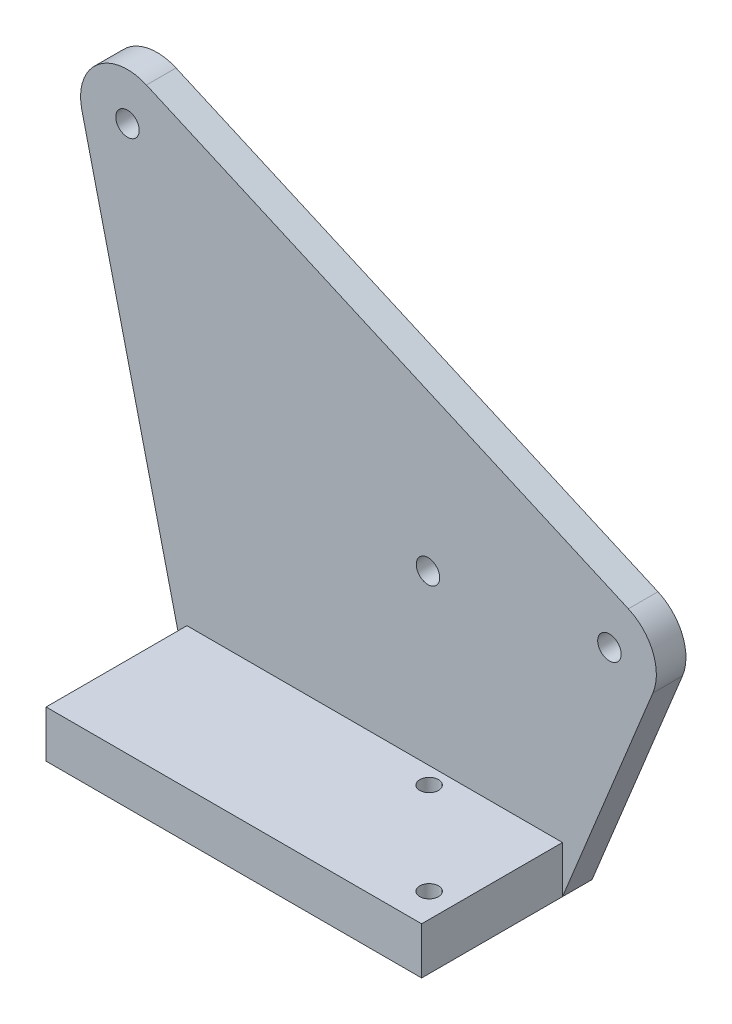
from build123d import *

# Parameters (mm, degrees)
SKETCH1_R           = 3.175
BOSS_EXTRUDE1_DEPTH = 4
SKETCH2_W           = 101.6
SKETCH2_H           = 12.7
BOSS_EXTRUDE2_DEPTH = 38.1
SKETCH3_R           = 3.175
CUT_EXTRUDE1_DEPTH  = 8
SKETCH4_R           = 2.54
CUT_EXTRUDE2_DEPTH  = 12.7


with BuildPart() as part:
    # Sketch1 → Boss-Extrude1 (new, symmetric)
    with BuildSketch(Plane.XY):
        with BuildLine():
            Line((5.127066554, 11.619087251), (-125.251133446, 69.150087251))
            ThreePointArc((-125.251133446, 69.150087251), (-138.50687017, 67.288803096), (-142.732372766, 54.587462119))
            Line((-142.732372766, 54.587462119), (-114.3, -64.7446))
            Line((-114.3, -64.7446), (-12.7, -64.7446))
            Line((-12.7, -64.7446), (11.7588969, -4.797743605))
            ThreePointArc((11.7588969, -4.797743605), (11.775484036, 4.756887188), (5.127066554, 11.619087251))
        make_face()
        with Locations((-130.3782, 57.531)):
            Circle(SKETCH1_R, mode=Mode.SUBTRACT)
        Circle(SKETCH1_R, mode=Mode.SUBTRACT)
    extrude(amount=BOSS_EXTRUDE1_DEPTH, both=True)

    # Sketch2 → Boss-Extrude2 (add)
    with BuildSketch(Plane.XY.offset(4)):
        with Locations((-63.5, -58.3946)):
            Rectangle(SKETCH2_W, SKETCH2_H)
    extrude(amount=BOSS_EXTRUDE2_DEPTH)

    # Sketch3 → Cut-Extrude1 (cut)
    with BuildSketch(Plane.XY.offset(4)):
        with Locations((-49.081699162, -6.648887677)):
            Circle(SKETCH3_R)
    extrude(amount=-CUT_EXTRUDE1_DEPTH, mode=Mode.SUBTRACT)

    # Sketch4 → Cut-Extrude2 (cut)
    with BuildSketch(Plane.XZ.offset(64.7446)):
        with Locations(Location((-19.304, 33.464, 0), (0, 0, 270))):
            Circle(SKETCH4_R)
        with Locations(Location((-44.196, 8.572, 0), (0, 0, 270))):
            Circle(SKETCH4_R)
    extrude(amount=-CUT_EXTRUDE2_DEPTH, mode=Mode.SUBTRACT)


solid = part.part
